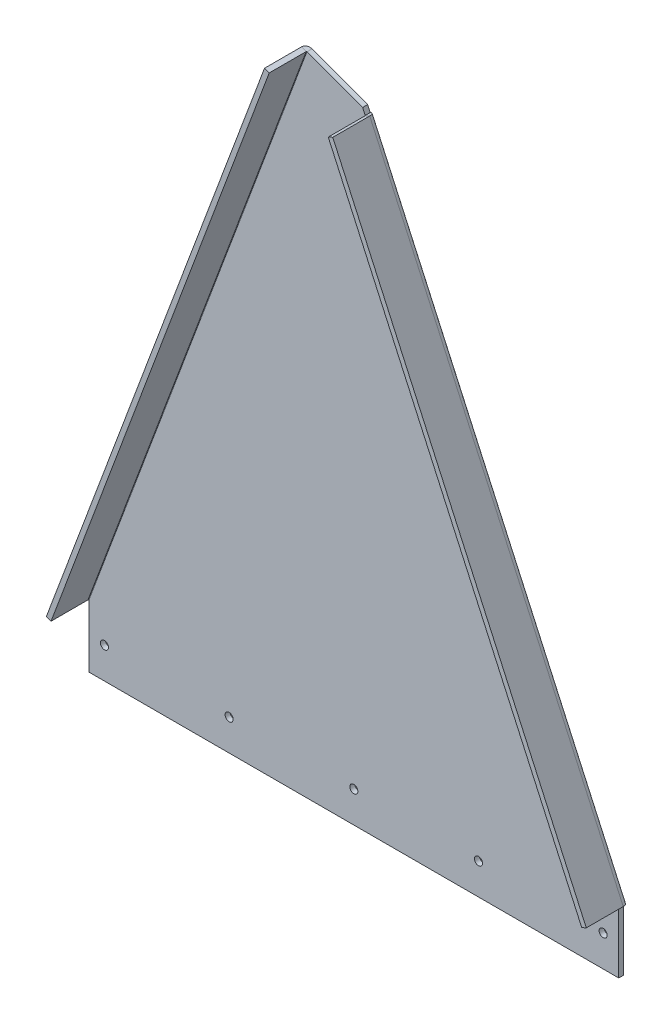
ISO-10303-21;
HEADER;
FILE_DESCRIPTION(('STEP AP214'),'2;1');
FILE_NAME('part.step','',(''),(''),'','','');
FILE_SCHEMA(('AUTOMOTIVE_DESIGN { 1 0 10303 214 1 1 1 1 }'));
ENDSEC;
DATA;
#1=APPLICATION_CONTEXT('core data for automotive mechanical design processes');
#2=APPLICATION_PROTOCOL_DEFINITION('international standard','automotive_design',2000,#1);
#3=PRODUCT_CONTEXT('',#1,'mechanical');
#4=PRODUCT('Part','Part','',(#3));
#5=PRODUCT_RELATED_PRODUCT_CATEGORY('part','',(#4));
#6=PRODUCT_DEFINITION_FORMATION('','',#4);
#7=PRODUCT_DEFINITION_CONTEXT('part definition',#1,'design');
#8=PRODUCT_DEFINITION('design','',#6,#7);
#9=PRODUCT_DEFINITION_SHAPE('','',#8);
#10=(LENGTH_UNIT() NAMED_UNIT(*) SI_UNIT(.MILLI.,.METRE.));
#11=(NAMED_UNIT(*) PLANE_ANGLE_UNIT() SI_UNIT($,.RADIAN.));
#12=(NAMED_UNIT(*) SI_UNIT($,.STERADIAN.) SOLID_ANGLE_UNIT());
#13=UNCERTAINTY_MEASURE_WITH_UNIT(LENGTH_MEASURE(1.E-05),#10,'distance_accuracy_value','');
#14=(GEOMETRIC_REPRESENTATION_CONTEXT(3) GLOBAL_UNCERTAINTY_ASSIGNED_CONTEXT((#13)) GLOBAL_UNIT_ASSIGNED_CONTEXT((#10,
#11,#12)) REPRESENTATION_CONTEXT('',''));
#15=CARTESIAN_POINT('',(0.,0.,0.));
#16=DIRECTION('',(0.,0.,1.));
#17=DIRECTION('',(1.,0.,0.));
#18=AXIS2_PLACEMENT_3D('',#15,#16,#17);
#19=CARTESIAN_POINT('',(-425.,100.,8.));
#20=DIRECTION('',(1.,0.,0.));
#21=DIRECTION('',(0.,1.,0.));
#22=AXIS2_PLACEMENT_3D('',#19,#20,#21);
#23=PLANE('',#22);
#24=DIRECTION('',(0.,-1.,0.));
#25=VECTOR('',#24,1.);
#26=CARTESIAN_POINT('',(-425.,100.,0.));
#27=LINE('',#26,#25);
#28=CARTESIAN_POINT('',(-424.999824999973,100.00046837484,-2.66973942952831E-12));
#29=VERTEX_POINT('',#28);
#30=CARTESIAN_POINT('',(-425.,0.,0.));
#31=VERTEX_POINT('',#30);
#32=EDGE_CURVE('E650',#29,#31,#27,.T.);
#33=ORIENTED_EDGE('',*,*,#32,.T.);
#34=DIRECTION('',(0.,0.,-1.));
#35=VECTOR('',#34,1.);
#36=CARTESIAN_POINT('',(-425.,0.,8.));
#37=LINE('',#36,#35);
#38=CARTESIAN_POINT('',(-425.,0.,8.));
#39=VERTEX_POINT('',#38);
#40=EDGE_CURVE('E265',#39,#31,#37,.T.);
#41=ORIENTED_EDGE('',*,*,#40,.F.);
#42=DIRECTION('',(0.,-1.,0.));
#43=VECTOR('',#42,1.);
#44=CARTESIAN_POINT('',(-425.,100.,8.));
#45=LINE('',#44,#43);
#46=CARTESIAN_POINT('',(-424.999825,100.00046837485,7.99999999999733));
#47=VERTEX_POINT('',#46);
#48=EDGE_CURVE('E609',#47,#39,#45,.T.);
#49=ORIENTED_EDGE('',*,*,#48,.F.);
#50=DIRECTION('',(0.,0.,1.));
#51=VECTOR('',#50,1.);
#52=CARTESIAN_POINT('',(-425.,100.001067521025,8.));
#53=LINE('',#52,#51);
#54=EDGE_CURVE('E632',#47,#29,#53,.F.);
#55=ORIENTED_EDGE('',*,*,#54,.T.);
#56=EDGE_LOOP('',(#33,#41,#49,#55));
#57=FACE_BOUND('',#56,.T.);
#58=ADVANCED_FACE('F83',(#57),#23,.F.);
#59=CARTESIAN_POINT('',(-425.,0.,8.));
#60=DIRECTION('',(0.,1.,0.));
#61=DIRECTION('',(-1.,0.,0.));
#62=AXIS2_PLACEMENT_3D('',#59,#60,#61);
#63=PLANE('',#62);
#64=DIRECTION('',(1.,0.,0.));
#65=VECTOR('',#64,1.);
#66=CARTESIAN_POINT('',(-425.,0.,0.));
#67=LINE('',#66,#65);
#68=CARTESIAN_POINT('',(425.,0.,0.));
#69=VERTEX_POINT('',#68);
#70=EDGE_CURVE('E586',#31,#69,#67,.T.);
#71=ORIENTED_EDGE('',*,*,#70,.T.);
#72=DIRECTION('',(0.,0.,-1.));
#73=VECTOR('',#72,1.);
#74=CARTESIAN_POINT('',(425.,0.,8.));
#75=LINE('',#74,#73);
#76=CARTESIAN_POINT('',(425.,0.,8.));
#77=VERTEX_POINT('',#76);
#78=EDGE_CURVE('E583',#77,#69,#75,.T.);
#79=ORIENTED_EDGE('',*,*,#78,.F.);
#80=DIRECTION('',(1.,0.,0.));
#81=VECTOR('',#80,1.);
#82=CARTESIAN_POINT('',(-425.,0.,8.));
#83=LINE('',#82,#81);
#84=EDGE_CURVE('E606',#39,#77,#83,.T.);
#85=ORIENTED_EDGE('',*,*,#84,.F.);
#86=ORIENTED_EDGE('',*,*,#40,.T.);
#87=EDGE_LOOP('',(#71,#79,#85,#86));
#88=FACE_BOUND('',#87,.T.);
#89=ADVANCED_FACE('F298',(#88),#63,.F.);
#90=CARTESIAN_POINT('',(425.,0.,8.));
#91=DIRECTION('',(-1.,0.,0.));
#92=DIRECTION('',(0.,0.,1.));
#93=AXIS2_PLACEMENT_3D('',#90,#91,#92);
#94=PLANE('',#93);
#95=DIRECTION('',(0.,1.,0.));
#96=VECTOR('',#95,1.);
#97=CARTESIAN_POINT('',(425.,0.,0.));
#98=LINE('',#97,#96);
#99=CARTESIAN_POINT('',(424.999999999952,99.9999999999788,-4.27609336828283E-12));
#100=VERTEX_POINT('',#99);
#101=EDGE_CURVE('E579',#69,#100,#98,.T.);
#102=ORIENTED_EDGE('',*,*,#101,.T.);
#103=DIRECTION('',(0.,0.,-1.));
#104=VECTOR('',#103,1.);
#105=CARTESIAN_POINT('',(425.,100.,8.));
#106=LINE('',#105,#104);
#107=CARTESIAN_POINT('',(424.999999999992,99.9999999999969,7.99999999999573));
#108=VERTEX_POINT('',#107);
#109=EDGE_CURVE('E581',#108,#100,#106,.T.);
#110=ORIENTED_EDGE('',*,*,#109,.F.);
#111=DIRECTION('',(0.,1.,0.));
#112=VECTOR('',#111,1.);
#113=CARTESIAN_POINT('',(425.,0.,8.));
#114=LINE('',#113,#112);
#115=EDGE_CURVE('E608',#77,#108,#114,.T.);
#116=ORIENTED_EDGE('',*,*,#115,.F.);
#117=ORIENTED_EDGE('',*,*,#78,.T.);
#118=EDGE_LOOP('',(#102,#110,#116,#117));
#119=FACE_BOUND('',#118,.T.);
#120=ADVANCED_FACE('F305',(#119),#94,.F.);
#121=CARTESIAN_POINT('',(425.,100.,8.));
#122=DIRECTION('',(-0.91041077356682,-0.413705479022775,0.));
#123=DIRECTION('',(0.413705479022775,-0.91041077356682,0.));
#124=AXIS2_PLACEMENT_3D('',#121,#122,#123);
#125=PLANE('',#124);
#126=DIRECTION('',(-0.413705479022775,0.91041077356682,0.));
#127=VECTOR('',#126,1.);
#128=CARTESIAN_POINT('',(425.,100.,8.));
#129=LINE('',#128,#127);
#130=CARTESIAN_POINT('',(18.3275141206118,994.933790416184,7.99999999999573));
#131=VERTEX_POINT('',#130);
#132=CARTESIAN_POINT('',(14.1904593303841,1004.03789815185,8.));
#133=VERTEX_POINT('',#132);
#134=EDGE_CURVE('E599',#131,#133,#129,.T.);
#135=ORIENTED_EDGE('',*,*,#134,.F.);
#136=DIRECTION('',(-4.99719038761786E-12,-2.27080467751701E-12,-1.));
#137=VECTOR('',#136,1.);
#138=CARTESIAN_POINT('',(18.3275141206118,994.933790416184,7.99999999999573));
#139=LINE('',#138,#137);
#140=CARTESIAN_POINT('',(18.3275141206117,994.933790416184,0.));
#141=VERTEX_POINT('',#140);
#142=EDGE_CURVE('E244',#131,#141,#139,.T.);
#143=ORIENTED_EDGE('',*,*,#142,.T.);
#144=DIRECTION('',(-0.413705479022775,0.91041077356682,0.));
#145=VECTOR('',#144,1.);
#146=CARTESIAN_POINT('',(425.,100.,0.));
#147=LINE('',#146,#145);
#148=CARTESIAN_POINT('',(14.1904593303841,1004.03789815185,0.));
#149=VERTEX_POINT('',#148);
#150=EDGE_CURVE('E585',#141,#149,#147,.T.);
#151=ORIENTED_EDGE('',*,*,#150,.T.);
#152=DIRECTION('',(0.,0.,-1.));
#153=VECTOR('',#152,1.);
#154=CARTESIAN_POINT('',(14.1904593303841,1004.03789815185,8.));
#155=LINE('',#154,#153);
#156=EDGE_CURVE('E624',#133,#149,#155,.T.);
#157=ORIENTED_EDGE('',*,*,#156,.F.);
#158=EDGE_LOOP('',(#135,#143,#151,#157));
#159=FACE_BOUND('',#158,.T.);
#160=ADVANCED_FACE('F292',(#159),#125,.F.);
#161=CARTESIAN_POINT('',(14.1904593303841,1004.03789815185,8.));
#162=DIRECTION('',(-0.344334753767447,-0.938846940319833,0.));
#163=DIRECTION('',(0.938846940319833,-0.344334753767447,0.));
#164=AXIS2_PLACEMENT_3D('',#161,#162,#163);
#165=PLANE('',#164);
#166=DIRECTION('',(-0.938846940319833,0.344334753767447,0.));
#167=VECTOR('',#166,1.);
#168=CARTESIAN_POINT('',(14.1904593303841,1004.03789815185,0.));
#169=LINE('',#168,#167);
#170=CARTESIAN_POINT('',(-75.0000000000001,1036.74969975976,0.));
#171=VERTEX_POINT('',#170);
#172=EDGE_CURVE('E591',#149,#171,#169,.T.);
#173=ORIENTED_EDGE('',*,*,#172,.T.);
#174=DIRECTION('',(0.,0.,-1.));
#175=VECTOR('',#174,1.);
#176=CARTESIAN_POINT('',(-75.0000000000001,1036.74969975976,8.));
#177=LINE('',#176,#175);
#178=CARTESIAN_POINT('',(-75.0000000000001,1036.74969975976,8.));
#179=VERTEX_POINT('',#178);
#180=EDGE_CURVE('E625',#179,#171,#177,.T.);
#181=ORIENTED_EDGE('',*,*,#180,.F.);
#182=DIRECTION('',(-0.938846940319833,0.344334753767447,0.));
#183=VECTOR('',#182,1.);
#184=CARTESIAN_POINT('',(14.1904593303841,1004.03789815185,8.));
#185=LINE('',#184,#183);
#186=EDGE_CURVE('E613',#133,#179,#185,.T.);
#187=ORIENTED_EDGE('',*,*,#186,.F.);
#188=ORIENTED_EDGE('',*,*,#156,.T.);
#189=EDGE_LOOP('',(#173,#181,#187,#188));
#190=FACE_BOUND('',#189,.T.);
#191=ADVANCED_FACE('F281',(#190),#165,.F.);
#192=CARTESIAN_POINT('',(-425.,0.,8.));
#193=DIRECTION('',(0.,0.,1.));
#194=DIRECTION('',(1.,0.,0.));
#195=AXIS2_PLACEMENT_3D('',#192,#193,#194);
#196=PLANE('',#195);
#197=CARTESIAN_POINT('',(-199.999912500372,50.,8.));
#198=DIRECTION('',(0.,0.,1.));
#199=DIRECTION('',(1.,0.,0.));
#200=AXIS2_PLACEMENT_3D('',#197,#198,#199);
#201=CIRCLE('',#200,6.50000000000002);
#202=CARTESIAN_POINT('',(-193.499912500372,50.,8.));
#203=VERTEX_POINT('',#202);
#204=EDGE_CURVE('E722',#203,#203,#201,.T.);
#205=ORIENTED_EDGE('',*,*,#204,.F.);
#206=EDGE_LOOP('',(#205));
#207=FACE_BOUND('',#206,.T.);
#208=CARTESIAN_POINT('',(-399.999912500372,50.,8.));
#209=DIRECTION('',(0.,0.,1.));
#210=DIRECTION('',(1.,0.,0.));
#211=AXIS2_PLACEMENT_3D('',#208,#209,#210);
#212=CIRCLE('',#211,6.50000000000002);
#213=CARTESIAN_POINT('',(-393.499912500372,50.,8.));
#214=VERTEX_POINT('',#213);
#215=EDGE_CURVE('E260',#214,#214,#212,.T.);
#216=ORIENTED_EDGE('',*,*,#215,.F.);
#217=EDGE_LOOP('',(#216));
#218=FACE_BOUND('',#217,.T.);
#219=ORIENTED_EDGE('',*,*,#48,.T.);
#220=ORIENTED_EDGE('',*,*,#84,.T.);
#221=ORIENTED_EDGE('',*,*,#115,.T.);
#222=EDGE_CURVE('E616',#108,#131,#129,.T.);
#223=ORIENTED_EDGE('',*,*,#222,.T.);
#224=ORIENTED_EDGE('',*,*,#134,.T.);
#225=ORIENTED_EDGE('',*,*,#186,.T.);
#226=DIRECTION('',(-0.35,-0.93674969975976,0.));
#227=VECTOR('',#226,1.);
#228=CARTESIAN_POINT('',(-75.0000000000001,1036.74969975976,8.));
#229=LINE('',#228,#227);
#230=EDGE_CURVE('E106',#179,#47,#229,.T.);
#231=ORIENTED_EDGE('',*,*,#230,.T.);
#232=EDGE_LOOP('',(#219,#220,#221,#223,#224,#225,#231));
#233=FACE_BOUND('',#232,.T.);
#234=CARTESIAN_POINT('',(8.74996284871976E-05,50.,8.));
#235=DIRECTION('',(0.,0.,1.));
#236=DIRECTION('',(1.,0.,0.));
#237=AXIS2_PLACEMENT_3D('',#234,#235,#236);
#238=CIRCLE('',#237,6.50000000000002);
#239=CARTESIAN_POINT('',(6.5000874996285,50.,8.));
#240=VERTEX_POINT('',#239);
#241=EDGE_CURVE('E261',#240,#240,#238,.T.);
#242=ORIENTED_EDGE('',*,*,#241,.F.);
#243=EDGE_LOOP('',(#242));
#244=FACE_BOUND('',#243,.T.);
#245=CARTESIAN_POINT('',(200.000087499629,50.,8.));
#246=DIRECTION('',(0.,0.,1.));
#247=DIRECTION('',(1.,0.,0.));
#248=AXIS2_PLACEMENT_3D('',#245,#246,#247);
#249=CIRCLE('',#248,6.50000000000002);
#250=CARTESIAN_POINT('',(206.500087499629,50.,8.));
#251=VERTEX_POINT('',#250);
#252=EDGE_CURVE('E268',#251,#251,#249,.T.);
#253=ORIENTED_EDGE('',*,*,#252,.F.);
#254=EDGE_LOOP('',(#253));
#255=FACE_BOUND('',#254,.T.);
#256=CARTESIAN_POINT('',(400.000087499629,50.,8.));
#257=DIRECTION('',(0.,0.,1.));
#258=DIRECTION('',(1.,0.,0.));
#259=AXIS2_PLACEMENT_3D('',#256,#257,#258);
#260=CIRCLE('',#259,6.50000000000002);
#261=CARTESIAN_POINT('',(406.500087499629,50.,8.));
#262=VERTEX_POINT('',#261);
#263=EDGE_CURVE('E91',#262,#262,#260,.T.);
#264=ORIENTED_EDGE('',*,*,#263,.F.);
#265=EDGE_LOOP('',(#264));
#266=FACE_BOUND('',#265,.T.);
#267=ADVANCED_FACE('F278',(#207,#218,#233,#244,#255,#266),#196,.T.);
#268=CARTESIAN_POINT('',(-425.,0.,0.));
#269=DIRECTION('',(0.,0.,1.));
#270=DIRECTION('',(1.,0.,0.));
#271=AXIS2_PLACEMENT_3D('',#268,#269,#270);
#272=PLANE('',#271);
#273=CARTESIAN_POINT('',(-199.999912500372,50.,0.));
#274=DIRECTION('',(0.,0.,1.));
#275=DIRECTION('',(1.,0.,0.));
#276=AXIS2_PLACEMENT_3D('',#273,#274,#275);
#277=CIRCLE('',#276,6.50000000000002);
#278=CARTESIAN_POINT('',(-193.499912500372,50.,0.));
#279=VERTEX_POINT('',#278);
#280=EDGE_CURVE('E719',#279,#279,#277,.T.);
#281=ORIENTED_EDGE('',*,*,#280,.T.);
#282=EDGE_LOOP('',(#281));
#283=FACE_BOUND('',#282,.T.);
#284=CARTESIAN_POINT('',(-399.999912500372,50.,0.));
#285=DIRECTION('',(0.,0.,1.));
#286=DIRECTION('',(1.,0.,0.));
#287=AXIS2_PLACEMENT_3D('',#284,#285,#286);
#288=CIRCLE('',#287,6.50000000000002);
#289=CARTESIAN_POINT('',(-393.499912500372,50.,0.));
#290=VERTEX_POINT('',#289);
#291=EDGE_CURVE('E240',#290,#290,#288,.T.);
#292=ORIENTED_EDGE('',*,*,#291,.T.);
#293=EDGE_LOOP('',(#292));
#294=FACE_BOUND('',#293,.T.);
#295=ORIENTED_EDGE('',*,*,#32,.F.);
#296=DIRECTION('',(-0.35,-0.93674969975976,0.));
#297=VECTOR('',#296,1.);
#298=CARTESIAN_POINT('',(-75.0000000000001,1036.74969975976,0.));
#299=LINE('',#298,#297);
#300=EDGE_CURVE('E593',#171,#29,#299,.T.);
#301=ORIENTED_EDGE('',*,*,#300,.F.);
#302=ORIENTED_EDGE('',*,*,#172,.F.);
#303=ORIENTED_EDGE('',*,*,#150,.F.);
#304=EDGE_CURVE('E195',#100,#141,#147,.T.);
#305=ORIENTED_EDGE('',*,*,#304,.F.);
#306=ORIENTED_EDGE('',*,*,#101,.F.);
#307=ORIENTED_EDGE('',*,*,#70,.F.);
#308=EDGE_LOOP('',(#295,#301,#302,#303,#305,#306,#307));
#309=FACE_BOUND('',#308,.T.);
#310=CARTESIAN_POINT('',(8.74996284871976E-05,50.,0.));
#311=DIRECTION('',(0.,0.,1.));
#312=DIRECTION('',(1.,0.,0.));
#313=AXIS2_PLACEMENT_3D('',#310,#311,#312);
#314=CIRCLE('',#313,6.50000000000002);
#315=CARTESIAN_POINT('',(6.5000874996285,50.,0.));
#316=VERTEX_POINT('',#315);
#317=EDGE_CURVE('E264',#316,#316,#314,.T.);
#318=ORIENTED_EDGE('',*,*,#317,.T.);
#319=EDGE_LOOP('',(#318));
#320=FACE_BOUND('',#319,.T.);
#321=CARTESIAN_POINT('',(200.000087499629,50.,0.));
#322=DIRECTION('',(0.,0.,1.));
#323=DIRECTION('',(1.,0.,0.));
#324=AXIS2_PLACEMENT_3D('',#321,#322,#323);
#325=CIRCLE('',#324,6.50000000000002);
#326=CARTESIAN_POINT('',(206.500087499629,50.,0.));
#327=VERTEX_POINT('',#326);
#328=EDGE_CURVE('E271',#327,#327,#325,.T.);
#329=ORIENTED_EDGE('',*,*,#328,.T.);
#330=EDGE_LOOP('',(#329));
#331=FACE_BOUND('',#330,.T.);
#332=CARTESIAN_POINT('',(400.000087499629,50.,0.));
#333=DIRECTION('',(0.,0.,1.));
#334=DIRECTION('',(1.,0.,0.));
#335=AXIS2_PLACEMENT_3D('',#332,#333,#334);
#336=CIRCLE('',#335,6.50000000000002);
#337=CARTESIAN_POINT('',(406.500087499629,50.,0.));
#338=VERTEX_POINT('',#337);
#339=EDGE_CURVE('E13',#338,#338,#336,.T.);
#340=ORIENTED_EDGE('',*,*,#339,.T.);
#341=EDGE_LOOP('',(#340));
#342=FACE_BOUND('',#341,.T.);
#343=ADVANCED_FACE('F280',(#283,#294,#309,#320,#331,#342),#272,.F.);
#344=CARTESIAN_POINT('',(-74.9999999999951,1036.74969975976,8.73660000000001));
#345=DIRECTION('',(0.35000000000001,0.936749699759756,0.));
#346=DIRECTION('',(-0.936749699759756,0.35000000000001,0.));
#347=AXIS2_PLACEMENT_3D('',#344,#345,#346);
#348=PLANE('',#347);
#349=DIRECTION('',(-0.93674969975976,0.35,0.));
#350=VECTOR('',#349,1.);
#351=CARTESIAN_POINT('',(-83.1840074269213,1039.80750975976,8.73659999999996));
#352=LINE('',#351,#350);
#353=CARTESIAN_POINT('',(-75.6900098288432,1037.00750975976,8.73660000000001));
#354=VERTEX_POINT('',#353);
#355=CARTESIAN_POINT('',(-83.1840074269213,1039.80750975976,8.7366));
#356=VERTEX_POINT('',#355);
#357=EDGE_CURVE('E252',#354,#356,#352,.T.);
#358=ORIENTED_EDGE('',*,*,#357,.F.);
#359=CARTESIAN_POINT('',(-74.9999999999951,1036.74969975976,8.73660000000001));
#360=DIRECTION('',(-0.35000000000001,-0.936749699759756,0.));
#361=DIRECTION('',(0.936749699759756,-0.35000000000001,0.));
#362=AXIS2_PLACEMENT_3D('',#359,#360,#361);
#363=CIRCLE('',#362,0.736600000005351);
#364=EDGE_CURVE('E635',#179,#354,#363,.F.);
#365=ORIENTED_EDGE('',*,*,#364,.F.);
#366=ORIENTED_EDGE('',*,*,#180,.T.);
#367=CARTESIAN_POINT('',(-74.9999999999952,1036.74969975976,8.73660000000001));
#368=DIRECTION('',(-0.35000000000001,-0.936749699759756,0.));
#369=DIRECTION('',(0.936749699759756,-0.35000000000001,0.));
#370=AXIS2_PLACEMENT_3D('',#367,#368,#369);
#371=CIRCLE('',#370,8.73660000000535);
#372=EDGE_CURVE('E644',#171,#356,#371,.F.);
#373=ORIENTED_EDGE('',*,*,#372,.T.);
#374=EDGE_LOOP('',(#358,#365,#366,#373));
#375=FACE_BOUND('',#374,.T.);
#376=ADVANCED_FACE('F288',(#375),#348,.T.);
#377=CARTESIAN_POINT('',(-424.999650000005,100.000936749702,8.73660000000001));
#378=DIRECTION('',(0.35000000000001,0.936749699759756,0.));
#379=DIRECTION('',(-0.936749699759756,0.35000000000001,0.));
#380=AXIS2_PLACEMENT_3D('',#377,#378,#379);
#381=PLANE('',#380);
#382=CARTESIAN_POINT('',(-424.999650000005,100.000936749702,8.73660000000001));
#383=DIRECTION('',(-0.35000000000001,-0.936749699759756,0.));
#384=DIRECTION('',(0.936749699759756,-0.35000000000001,0.));
#385=AXIS2_PLACEMENT_3D('',#382,#383,#384);
#386=CIRCLE('',#385,0.736600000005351);
#387=CARTESIAN_POINT('',(-425.689659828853,100.258746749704,8.73660000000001));
#388=VERTEX_POINT('',#387);
#389=EDGE_CURVE('E638',#388,#47,#386,.T.);
#390=ORIENTED_EDGE('',*,*,#389,.F.);
#391=DIRECTION('',(-0.93674969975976,0.35,0.));
#392=VECTOR('',#391,1.);
#393=CARTESIAN_POINT('',(-425.689659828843,100.2587467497,8.73660000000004));
#394=LINE('',#393,#392);
#395=CARTESIAN_POINT('',(-433.183657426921,103.0587467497,8.73660000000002));
#396=VERTEX_POINT('',#395);
#397=EDGE_CURVE('E670',#388,#396,#394,.T.);
#398=ORIENTED_EDGE('',*,*,#397,.T.);
#399=CARTESIAN_POINT('',(-424.999650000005,100.000936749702,8.73660000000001));
#400=DIRECTION('',(-0.35000000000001,-0.936749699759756,0.));
#401=DIRECTION('',(0.936749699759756,-0.35000000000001,0.));
#402=AXIS2_PLACEMENT_3D('',#399,#400,#401);
#403=CIRCLE('',#402,8.73660000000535);
#404=EDGE_CURVE('E641',#396,#29,#403,.T.);
#405=ORIENTED_EDGE('',*,*,#404,.T.);
#406=ORIENTED_EDGE('',*,*,#54,.F.);
#407=EDGE_LOOP('',(#390,#398,#405,#406));
#408=FACE_BOUND('',#407,.T.);
#409=ADVANCED_FACE('F504',(#408),#381,.F.);
#410=CARTESIAN_POINT('',(-424.999650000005,100.000936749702,8.73660000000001));
#411=DIRECTION('',(-0.35000000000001,-0.936749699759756,0.));
#412=DIRECTION('',(-0.936749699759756,0.35000000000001,0.));
#413=AXIS2_PLACEMENT_3D('',#410,#411,#412);
#414=CYLINDRICAL_SURFACE('',#413,8.73660000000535);
#415=ORIENTED_EDGE('',*,*,#300,.T.);
#416=ORIENTED_EDGE('',*,*,#404,.F.);
#417=DIRECTION('',(-0.35,-0.93674969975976,0.));
#418=VECTOR('',#417,1.);
#419=CARTESIAN_POINT('',(-433.183657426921,103.0587467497,8.73660000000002));
#420=LINE('',#419,#418);
#421=EDGE_CURVE('E675',#356,#396,#420,.T.);
#422=ORIENTED_EDGE('',*,*,#421,.F.);
#423=ORIENTED_EDGE('',*,*,#372,.F.);
#424=EDGE_LOOP('',(#415,#416,#422,#423));
#425=FACE_BOUND('',#424,.T.);
#426=ADVANCED_FACE('F501',(#425),#414,.T.);
#427=CARTESIAN_POINT('',(-424.999650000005,100.000936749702,8.73660000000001));
#428=DIRECTION('',(-0.35000000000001,-0.936749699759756,0.));
#429=DIRECTION('',(-0.936749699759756,0.35000000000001,0.));
#430=AXIS2_PLACEMENT_3D('',#427,#428,#429);
#431=CYLINDRICAL_SURFACE('',#430,0.736600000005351);
#432=ORIENTED_EDGE('',*,*,#230,.F.);
#433=ORIENTED_EDGE('',*,*,#364,.T.);
#434=DIRECTION('',(0.35,0.93674969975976,0.));
#435=VECTOR('',#434,1.);
#436=CARTESIAN_POINT('',(-75.6900098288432,1037.00750975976,8.73659999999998));
#437=LINE('',#436,#435);
#438=EDGE_CURVE('E676',#354,#388,#437,.F.);
#439=ORIENTED_EDGE('',*,*,#438,.T.);
#440=ORIENTED_EDGE('',*,*,#389,.T.);
#441=EDGE_LOOP('',(#432,#433,#439,#440));
#442=FACE_BOUND('',#441,.T.);
#443=ADVANCED_FACE('F491',(#442),#431,.F.);
#444=CARTESIAN_POINT('',(-433.183657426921,103.0587467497,7.99999999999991));
#445=DIRECTION('',(-0.35,-0.93674969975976,0.));
#446=DIRECTION('',(0.93674969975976,-0.35,0.));
#447=AXIS2_PLACEMENT_3D('',#444,#445,#446);
#448=PLANE('',#447);
#449=DIRECTION('',(0.,0.,-1.));
#450=VECTOR('',#449,1.);
#451=CARTESIAN_POINT('',(-433.183657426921,103.0587467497,7.99999999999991));
#452=LINE('',#451,#450);
#453=CARTESIAN_POINT('',(-433.183657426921,103.0587467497,68.));
#454=VERTEX_POINT('',#453);
#455=EDGE_CURVE('E681',#454,#396,#452,.T.);
#456=ORIENTED_EDGE('',*,*,#455,.T.);
#457=ORIENTED_EDGE('',*,*,#397,.F.);
#458=DIRECTION('',(0.,0.,1.));
#459=VECTOR('',#458,1.);
#460=CARTESIAN_POINT('',(-425.689659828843,100.2587467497,7.99999999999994));
#461=LINE('',#460,#459);
#462=CARTESIAN_POINT('',(-425.689659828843,100.2587467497,68.));
#463=VERTEX_POINT('',#462);
#464=EDGE_CURVE('E693',#463,#388,#461,.F.);
#465=ORIENTED_EDGE('',*,*,#464,.F.);
#466=DIRECTION('',(0.93674969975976,-0.35,0.));
#467=VECTOR('',#466,1.);
#468=CARTESIAN_POINT('',(-433.183657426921,103.0587467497,68.));
#469=LINE('',#468,#467);
#470=EDGE_CURVE('E247',#454,#463,#469,.T.);
#471=ORIENTED_EDGE('',*,*,#470,.F.);
#472=EDGE_LOOP('',(#456,#457,#465,#471));
#473=FACE_BOUND('',#472,.T.);
#474=ADVANCED_FACE('F481',(#473),#448,.T.);
#475=CARTESIAN_POINT('',(-83.1840074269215,1039.80750975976,68.));
#476=DIRECTION('',(0.35,0.93674969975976,0.));
#477=DIRECTION('',(-0.93674969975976,0.35,0.));
#478=AXIS2_PLACEMENT_3D('',#475,#476,#477);
#479=PLANE('',#478);
#480=DIRECTION('',(0.,0.,-1.));
#481=VECTOR('',#480,1.);
#482=CARTESIAN_POINT('',(-75.6900098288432,1037.00750975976,8.00000000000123));
#483=LINE('',#482,#481);
#484=CARTESIAN_POINT('',(-75.6900098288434,1037.00750975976,68.));
#485=VERTEX_POINT('',#484);
#486=EDGE_CURVE('E683',#354,#485,#483,.F.);
#487=ORIENTED_EDGE('',*,*,#486,.F.);
#488=ORIENTED_EDGE('',*,*,#357,.T.);
#489=DIRECTION('',(0.,0.,1.));
#490=VECTOR('',#489,1.);
#491=CARTESIAN_POINT('',(-83.1840074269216,1039.80750975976,68.));
#492=LINE('',#491,#490);
#493=CARTESIAN_POINT('',(-83.1840074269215,1039.80750975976,68.));
#494=VERTEX_POINT('',#493);
#495=EDGE_CURVE('E682',#356,#494,#492,.T.);
#496=ORIENTED_EDGE('',*,*,#495,.T.);
#497=DIRECTION('',(0.93674969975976,-0.35,0.));
#498=VECTOR('',#497,1.);
#499=CARTESIAN_POINT('',(-83.1840074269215,1039.80750975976,68.));
#500=LINE('',#499,#498);
#501=EDGE_CURVE('E686',#494,#485,#500,.T.);
#502=ORIENTED_EDGE('',*,*,#501,.T.);
#503=EDGE_LOOP('',(#487,#488,#496,#502));
#504=FACE_BOUND('',#503,.T.);
#505=ADVANCED_FACE('F471',(#504),#479,.T.);
#506=CARTESIAN_POINT('',(-433.183657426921,103.0587467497,7.99999999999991));
#507=DIRECTION('',(-0.93674969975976,0.35,0.));
#508=DIRECTION('',(-0.35,-0.93674969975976,0.));
#509=AXIS2_PLACEMENT_3D('',#506,#507,#508);
#510=PLANE('',#509);
#511=ORIENTED_EDGE('',*,*,#495,.F.);
#512=ORIENTED_EDGE('',*,*,#421,.T.);
#513=ORIENTED_EDGE('',*,*,#455,.F.);
#514=DIRECTION('',(-0.35,-0.93674969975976,0.));
#515=VECTOR('',#514,1.);
#516=CARTESIAN_POINT('',(-433.183657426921,103.0587467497,68.));
#517=LINE('',#516,#515);
#518=EDGE_CURVE('E687',#494,#454,#517,.T.);
#519=ORIENTED_EDGE('',*,*,#518,.F.);
#520=EDGE_LOOP('',(#511,#512,#513,#519));
#521=FACE_BOUND('',#520,.T.);
#522=ADVANCED_FACE('F461',(#521),#510,.T.);
#523=CARTESIAN_POINT('',(-425.689659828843,100.2587467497,7.99999999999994));
#524=DIRECTION('',(-0.93674969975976,0.35,0.));
#525=DIRECTION('',(-0.35,-0.93674969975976,0.));
#526=AXIS2_PLACEMENT_3D('',#523,#524,#525);
#527=PLANE('',#526);
#528=ORIENTED_EDGE('',*,*,#438,.F.);
#529=ORIENTED_EDGE('',*,*,#486,.T.);
#530=DIRECTION('',(0.35,0.93674969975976,0.));
#531=VECTOR('',#530,1.);
#532=CARTESIAN_POINT('',(-425.689659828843,100.2587467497,68.));
#533=LINE('',#532,#531);
#534=EDGE_CURVE('E695',#485,#463,#533,.F.);
#535=ORIENTED_EDGE('',*,*,#534,.T.);
#536=ORIENTED_EDGE('',*,*,#464,.T.);
#537=EDGE_LOOP('',(#528,#529,#535,#536));
#538=FACE_BOUND('',#537,.T.);
#539=ADVANCED_FACE('F451',(#538),#527,.F.);
#540=CARTESIAN_POINT('',(-433.183657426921,103.0587467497,68.));
#541=DIRECTION('',(0.,0.,1.));
#542=DIRECTION('',(1.,0.,0.));
#543=AXIS2_PLACEMENT_3D('',#540,#541,#542);
#544=PLANE('',#543);
#545=ORIENTED_EDGE('',*,*,#534,.F.);
#546=ORIENTED_EDGE('',*,*,#501,.F.);
#547=ORIENTED_EDGE('',*,*,#518,.T.);
#548=ORIENTED_EDGE('',*,*,#470,.T.);
#549=EDGE_LOOP('',(#545,#546,#547,#548));
#550=FACE_BOUND('',#549,.T.);
#551=ADVANCED_FACE('F441',(#550),#544,.T.);
#552=CARTESIAN_POINT('',(424.999999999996,99.9999999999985,8.73659999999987));
#553=DIRECTION('',(0.413705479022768,-0.910410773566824,0.));
#554=DIRECTION('',(0.910410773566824,0.413705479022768,0.));
#555=AXIS2_PLACEMENT_3D('',#552,#553,#554);
#556=PLANE('',#555);
#557=DIRECTION('',(0.91041077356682,0.413705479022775,0.));
#558=VECTOR('',#557,1.);
#559=CARTESIAN_POINT('',(432.953894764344,103.61437928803,8.73659999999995));
#560=LINE('',#559,#558);
#561=CARTESIAN_POINT('',(425.670608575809,100.304735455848,8.73659999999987));
#562=VERTEX_POINT('',#561);
#563=CARTESIAN_POINT('',(432.953894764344,103.614379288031,8.73659999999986));
#564=VERTEX_POINT('',#563);
#565=EDGE_CURVE('E237',#562,#564,#560,.T.);
#566=ORIENTED_EDGE('',*,*,#565,.F.);
#567=CARTESIAN_POINT('',(424.999999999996,99.9999999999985,8.73659999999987));
#568=DIRECTION('',(-0.413705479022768,0.910410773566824,0.));
#569=DIRECTION('',(-0.910410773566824,-0.413705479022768,0.));
#570=AXIS2_PLACEMENT_3D('',#567,#568,#569);
#571=CIRCLE('',#570,0.736600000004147);
#572=EDGE_CURVE('E198',#108,#562,#571,.F.);
#573=ORIENTED_EDGE('',*,*,#572,.F.);
#574=ORIENTED_EDGE('',*,*,#109,.T.);
#575=CARTESIAN_POINT('',(424.999999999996,99.9999999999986,8.73659999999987));
#576=DIRECTION('',(-0.413705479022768,0.910410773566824,0.));
#577=DIRECTION('',(-0.910410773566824,-0.413705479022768,0.));
#578=AXIS2_PLACEMENT_3D('',#575,#576,#577);
#579=CIRCLE('',#578,8.73660000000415);
#580=EDGE_CURVE('E197',#100,#564,#579,.F.);
#581=ORIENTED_EDGE('',*,*,#580,.T.);
#582=EDGE_LOOP('',(#566,#573,#574,#581));
#583=FACE_BOUND('',#582,.T.);
#584=ADVANCED_FACE('F425',(#583),#556,.T.);
#585=CARTESIAN_POINT('',(18.3275141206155,994.933790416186,8.73659999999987));
#586=DIRECTION('',(0.413705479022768,-0.910410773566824,0.));
#587=DIRECTION('',(0.910410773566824,0.413705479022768,0.));
#588=AXIS2_PLACEMENT_3D('',#585,#586,#587);
#589=PLANE('',#588);
#590=CARTESIAN_POINT('',(18.3275141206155,994.933790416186,8.73659999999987));
#591=DIRECTION('',(-0.413705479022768,0.910410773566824,0.));
#592=DIRECTION('',(-0.910410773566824,-0.413705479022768,0.));
#593=AXIS2_PLACEMENT_3D('',#590,#591,#592);
#594=CIRCLE('',#593,0.736600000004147);
#595=CARTESIAN_POINT('',(18.9981226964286,995.238525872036,8.73659999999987));
#596=VERTEX_POINT('',#595);
#597=EDGE_CURVE('E205',#596,#131,#594,.T.);
#598=ORIENTED_EDGE('',*,*,#597,.F.);
#599=DIRECTION('',(0.91041077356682,0.413705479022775,0.));
#600=VECTOR('',#599,1.);
#601=CARTESIAN_POINT('',(18.9981226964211,995.238525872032,8.73659999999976));
#602=LINE('',#601,#600);
#603=CARTESIAN_POINT('',(26.2814088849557,998.548169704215,8.73659999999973));
#604=VERTEX_POINT('',#603);
#605=EDGE_CURVE('E202',#596,#604,#602,.T.);
#606=ORIENTED_EDGE('',*,*,#605,.T.);
#607=CARTESIAN_POINT('',(18.3275141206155,994.933790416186,8.73659999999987));
#608=DIRECTION('',(-0.413705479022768,0.910410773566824,0.));
#609=DIRECTION('',(-0.910410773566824,-0.413705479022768,0.));
#610=AXIS2_PLACEMENT_3D('',#607,#608,#609);
#611=CIRCLE('',#610,8.73660000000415);
#612=EDGE_CURVE('E98',#604,#141,#611,.T.);
#613=ORIENTED_EDGE('',*,*,#612,.T.);
#614=ORIENTED_EDGE('',*,*,#142,.F.);
#615=EDGE_LOOP('',(#598,#606,#613,#614));
#616=FACE_BOUND('',#615,.T.);
#617=ADVANCED_FACE('F203',(#616),#589,.F.);
#618=CARTESIAN_POINT('',(18.3275141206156,994.933790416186,8.73659999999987));
#619=DIRECTION('',(-0.413705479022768,0.910410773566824,0.));
#620=DIRECTION('',(0.910410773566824,0.413705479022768,0.));
#621=AXIS2_PLACEMENT_3D('',#618,#619,#620);
#622=CYLINDRICAL_SURFACE('',#621,8.73660000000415);
#623=ORIENTED_EDGE('',*,*,#304,.T.);
#624=ORIENTED_EDGE('',*,*,#612,.F.);
#625=DIRECTION('',(-0.413705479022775,0.91041077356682,0.));
#626=VECTOR('',#625,1.);
#627=CARTESIAN_POINT('',(26.2814088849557,998.548169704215,8.73659999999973));
#628=LINE('',#627,#626);
#629=EDGE_CURVE('E192',#564,#604,#628,.T.);
#630=ORIENTED_EDGE('',*,*,#629,.F.);
#631=ORIENTED_EDGE('',*,*,#580,.F.);
#632=EDGE_LOOP('',(#623,#624,#630,#631));
#633=FACE_BOUND('',#632,.T.);
#634=ADVANCED_FACE('F189',(#633),#622,.T.);
#635=CARTESIAN_POINT('',(18.3275141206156,994.933790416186,8.73659999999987));
#636=DIRECTION('',(-0.413705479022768,0.910410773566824,0.));
#637=DIRECTION('',(0.910410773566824,0.413705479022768,0.));
#638=AXIS2_PLACEMENT_3D('',#635,#636,#637);
#639=CYLINDRICAL_SURFACE('',#638,0.736600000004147);
#640=ORIENTED_EDGE('',*,*,#222,.F.);
#641=ORIENTED_EDGE('',*,*,#572,.T.);
#642=DIRECTION('',(0.413705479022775,-0.91041077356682,0.));
#643=VECTOR('',#642,1.);
#644=CARTESIAN_POINT('',(425.670608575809,100.304735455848,8.73659999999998));
#645=LINE('',#644,#643);
#646=EDGE_CURVE('E210',#562,#596,#645,.F.);
#647=ORIENTED_EDGE('',*,*,#646,.T.);
#648=ORIENTED_EDGE('',*,*,#597,.T.);
#649=EDGE_LOOP('',(#640,#641,#647,#648));
#650=FACE_BOUND('',#649,.T.);
#651=ADVANCED_FACE('F405',(#650),#639,.F.);
#652=CARTESIAN_POINT('',(432.953894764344,103.61437928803,67.9999999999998));
#653=DIRECTION('',(0.413705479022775,-0.91041077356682,0.));
#654=DIRECTION('',(0.91041077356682,0.413705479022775,0.));
#655=AXIS2_PLACEMENT_3D('',#652,#653,#654);
#656=PLANE('',#655);
#657=DIRECTION('',(0.,0.,-1.));
#658=VECTOR('',#657,1.);
#659=CARTESIAN_POINT('',(425.67060857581,100.304735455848,67.9999999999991));
#660=LINE('',#659,#658);
#661=CARTESIAN_POINT('',(425.67060857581,100.304735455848,67.9999999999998));
#662=VERTEX_POINT('',#661);
#663=EDGE_CURVE('E227',#562,#662,#660,.F.);
#664=ORIENTED_EDGE('',*,*,#663,.F.);
#665=ORIENTED_EDGE('',*,*,#565,.T.);
#666=DIRECTION('',(0.,0.,1.));
#667=VECTOR('',#666,1.);
#668=CARTESIAN_POINT('',(432.953894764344,103.61437928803,67.9999999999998));
#669=LINE('',#668,#667);
#670=CARTESIAN_POINT('',(432.953894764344,103.614379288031,67.9999999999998));
#671=VERTEX_POINT('',#670);
#672=EDGE_CURVE('E219',#564,#671,#669,.T.);
#673=ORIENTED_EDGE('',*,*,#672,.T.);
#674=DIRECTION('',(-0.91041077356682,-0.413705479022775,0.));
#675=VECTOR('',#674,1.);
#676=CARTESIAN_POINT('',(432.953894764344,103.61437928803,67.9999999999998));
#677=LINE('',#676,#675);
#678=EDGE_CURVE('E255',#671,#662,#677,.T.);
#679=ORIENTED_EDGE('',*,*,#678,.T.);
#680=EDGE_LOOP('',(#664,#665,#673,#679));
#681=FACE_BOUND('',#680,.T.);
#682=ADVANCED_FACE('F396',(#681),#656,.T.);
#683=CARTESIAN_POINT('',(26.2814088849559,998.548169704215,67.9999999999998));
#684=DIRECTION('',(-0.413705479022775,0.91041077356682,0.));
#685=DIRECTION('',(-0.91041077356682,-0.413705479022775,0.));
#686=AXIS2_PLACEMENT_3D('',#683,#684,#685);
#687=PLANE('',#686);
#688=DIRECTION('',(0.,0.,-1.));
#689=VECTOR('',#688,1.);
#690=CARTESIAN_POINT('',(26.2814088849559,998.548169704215,67.9999999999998));
#691=LINE('',#690,#689);
#692=CARTESIAN_POINT('',(26.2814088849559,998.548169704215,67.9999999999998));
#693=VERTEX_POINT('',#692);
#694=EDGE_CURVE('E217',#693,#604,#691,.T.);
#695=ORIENTED_EDGE('',*,*,#694,.T.);
#696=ORIENTED_EDGE('',*,*,#605,.F.);
#697=DIRECTION('',(0.,0.,1.));
#698=VECTOR('',#697,1.);
#699=CARTESIAN_POINT('',(18.9981226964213,995.238525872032,67.9999999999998));
#700=LINE('',#699,#698);
#701=CARTESIAN_POINT('',(18.9981226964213,995.238525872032,67.9999999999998));
#702=VERTEX_POINT('',#701);
#703=EDGE_CURVE('E232',#702,#596,#700,.F.);
#704=ORIENTED_EDGE('',*,*,#703,.F.);
#705=DIRECTION('',(-0.91041077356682,-0.413705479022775,0.));
#706=VECTOR('',#705,1.);
#707=CARTESIAN_POINT('',(26.2814088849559,998.548169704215,67.9999999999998));
#708=LINE('',#707,#706);
#709=EDGE_CURVE('E223',#693,#702,#708,.T.);
#710=ORIENTED_EDGE('',*,*,#709,.F.);
#711=EDGE_LOOP('',(#695,#696,#704,#710));
#712=FACE_BOUND('',#711,.T.);
#713=ADVANCED_FACE('F222',(#712),#687,.T.);
#714=CARTESIAN_POINT('',(26.2814088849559,998.548169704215,67.9999999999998));
#715=DIRECTION('',(0.91041077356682,0.413705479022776,0.));
#716=DIRECTION('',(-0.413705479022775,0.91041077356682,0.));
#717=AXIS2_PLACEMENT_3D('',#714,#715,#716);
#718=PLANE('',#717);
#719=ORIENTED_EDGE('',*,*,#672,.F.);
#720=ORIENTED_EDGE('',*,*,#629,.T.);
#721=ORIENTED_EDGE('',*,*,#694,.F.);
#722=DIRECTION('',(-0.413705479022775,0.91041077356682,0.));
#723=VECTOR('',#722,1.);
#724=CARTESIAN_POINT('',(26.2814088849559,998.548169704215,67.9999999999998));
#725=LINE('',#724,#723);
#726=EDGE_CURVE('E224',#671,#693,#725,.T.);
#727=ORIENTED_EDGE('',*,*,#726,.F.);
#728=EDGE_LOOP('',(#719,#720,#721,#727));
#729=FACE_BOUND('',#728,.T.);
#730=ADVANCED_FACE('F215',(#729),#718,.T.);
#731=CARTESIAN_POINT('',(18.9981226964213,995.238525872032,67.9999999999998));
#732=DIRECTION('',(0.91041077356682,0.413705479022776,0.));
#733=DIRECTION('',(-0.413705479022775,0.91041077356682,0.));
#734=AXIS2_PLACEMENT_3D('',#731,#732,#733);
#735=PLANE('',#734);
#736=ORIENTED_EDGE('',*,*,#646,.F.);
#737=ORIENTED_EDGE('',*,*,#663,.T.);
#738=DIRECTION('',(0.413705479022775,-0.91041077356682,0.));
#739=VECTOR('',#738,1.);
#740=CARTESIAN_POINT('',(18.9981226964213,995.238525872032,67.9999999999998));
#741=LINE('',#740,#739);
#742=EDGE_CURVE('E220',#662,#702,#741,.F.);
#743=ORIENTED_EDGE('',*,*,#742,.T.);
#744=ORIENTED_EDGE('',*,*,#703,.T.);
#745=EDGE_LOOP('',(#736,#737,#743,#744));
#746=FACE_BOUND('',#745,.T.);
#747=ADVANCED_FACE('F369',(#746),#735,.F.);
#748=CARTESIAN_POINT('',(26.2814088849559,998.548169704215,67.9999999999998));
#749=DIRECTION('',(0.,0.,1.));
#750=DIRECTION('',(1.,0.,0.));
#751=AXIS2_PLACEMENT_3D('',#748,#749,#750);
#752=PLANE('',#751);
#753=ORIENTED_EDGE('',*,*,#742,.F.);
#754=ORIENTED_EDGE('',*,*,#678,.F.);
#755=ORIENTED_EDGE('',*,*,#726,.T.);
#756=ORIENTED_EDGE('',*,*,#709,.T.);
#757=EDGE_LOOP('',(#753,#754,#755,#756));
#758=FACE_BOUND('',#757,.T.);
#759=ADVANCED_FACE('F359',(#758),#752,.T.);
#760=CARTESIAN_POINT('',(-399.999912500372,50.,-2.));
#761=DIRECTION('',(0.,0.,1.));
#762=DIRECTION('',(1.,0.,0.));
#763=AXIS2_PLACEMENT_3D('',#760,#761,#762);
#764=CYLINDRICAL_SURFACE('',#763,6.50000000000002);
#765=ORIENTED_EDGE('',*,*,#215,.T.);
#766=EDGE_LOOP('',(#765));
#767=FACE_BOUND('',#766,.T.);
#768=ORIENTED_EDGE('',*,*,#291,.F.);
#769=EDGE_LOOP('',(#768));
#770=FACE_BOUND('',#769,.T.);
#771=ADVANCED_FACE('F350',(#767,#770),#764,.F.);
#772=CARTESIAN_POINT('',(-199.999912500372,50.,-2.));
#773=DIRECTION('',(0.,0.,1.));
#774=DIRECTION('',(1.,0.,0.));
#775=AXIS2_PLACEMENT_3D('',#772,#773,#774);
#776=CYLINDRICAL_SURFACE('',#775,6.50000000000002);
#777=ORIENTED_EDGE('',*,*,#204,.T.);
#778=EDGE_LOOP('',(#777));
#779=FACE_BOUND('',#778,.T.);
#780=ORIENTED_EDGE('',*,*,#280,.F.);
#781=EDGE_LOOP('',(#780));
#782=FACE_BOUND('',#781,.T.);
#783=ADVANCED_FACE('F314',(#779,#782),#776,.F.);
#784=CARTESIAN_POINT('',(8.74996284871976E-05,50.,-2.));
#785=DIRECTION('',(0.,0.,1.));
#786=DIRECTION('',(1.,0.,0.));
#787=AXIS2_PLACEMENT_3D('',#784,#785,#786);
#788=CYLINDRICAL_SURFACE('',#787,6.50000000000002);
#789=ORIENTED_EDGE('',*,*,#241,.T.);
#790=EDGE_LOOP('',(#789));
#791=FACE_BOUND('',#790,.T.);
#792=ORIENTED_EDGE('',*,*,#317,.F.);
#793=EDGE_LOOP('',(#792));
#794=FACE_BOUND('',#793,.T.);
#795=ADVANCED_FACE('F311',(#791,#794),#788,.F.);
#796=CARTESIAN_POINT('',(200.000087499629,50.,-2.));
#797=DIRECTION('',(0.,0.,1.));
#798=DIRECTION('',(1.,0.,0.));
#799=AXIS2_PLACEMENT_3D('',#796,#797,#798);
#800=CYLINDRICAL_SURFACE('',#799,6.50000000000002);
#801=ORIENTED_EDGE('',*,*,#252,.T.);
#802=EDGE_LOOP('',(#801));
#803=FACE_BOUND('',#802,.T.);
#804=ORIENTED_EDGE('',*,*,#328,.F.);
#805=EDGE_LOOP('',(#804));
#806=FACE_BOUND('',#805,.T.);
#807=ADVANCED_FACE('F313',(#803,#806),#800,.F.);
#808=CARTESIAN_POINT('',(400.000087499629,50.,-2.));
#809=DIRECTION('',(0.,0.,1.));
#810=DIRECTION('',(1.,0.,0.));
#811=AXIS2_PLACEMENT_3D('',#808,#809,#810);
#812=CYLINDRICAL_SURFACE('',#811,6.50000000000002);
#813=ORIENTED_EDGE('',*,*,#263,.T.);
#814=EDGE_LOOP('',(#813));
#815=FACE_BOUND('',#814,.T.);
#816=ORIENTED_EDGE('',*,*,#339,.F.);
#817=EDGE_LOOP('',(#816));
#818=FACE_BOUND('',#817,.T.);
#819=ADVANCED_FACE('F85',(#815,#818),#812,.F.);
#820=CLOSED_SHELL('',(#58,#89,#120,#160,#191,#267,#343,#376,#409,#426,#443,#474,#505,#522,#539,
#551,#584,#617,#634,#651,#682,#713,#730,#747,#759,#771,#783,#795,#807,#819));
#821=MANIFOLD_SOLID_BREP('B2',#820);
#822=ADVANCED_BREP_SHAPE_REPRESENTATION('',(#18,#821),#14);
#823=SHAPE_DEFINITION_REPRESENTATION(#9,#822);
ENDSEC;
END-ISO-10303-21;
